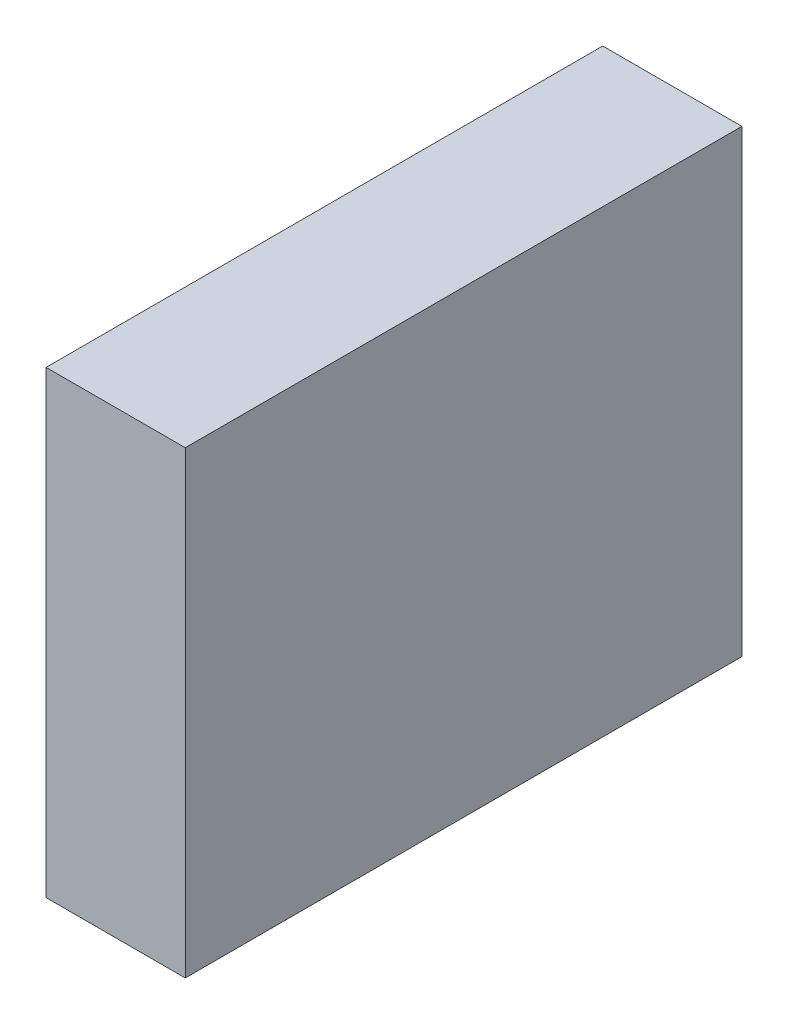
from build123d import *

# Parameters (mm, degrees)
SKETCH1_W           = 2.54
SKETCH1_H           = 10.16
BOSS_EXTRUDE1_DEPTH = 8.382


with BuildPart() as part:
    # Sketch1 → Boss-Extrude1 (new body)
    with BuildSketch(Plane(origin=(0, 0, 0), x_dir=(1, 0, 0), z_dir=(0, 1, 0))):
        with Locations((1.27, 5.08)):
            Rectangle(SKETCH1_W, SKETCH1_H)
    extrude(amount=BOSS_EXTRUDE1_DEPTH)


solid = part.part
